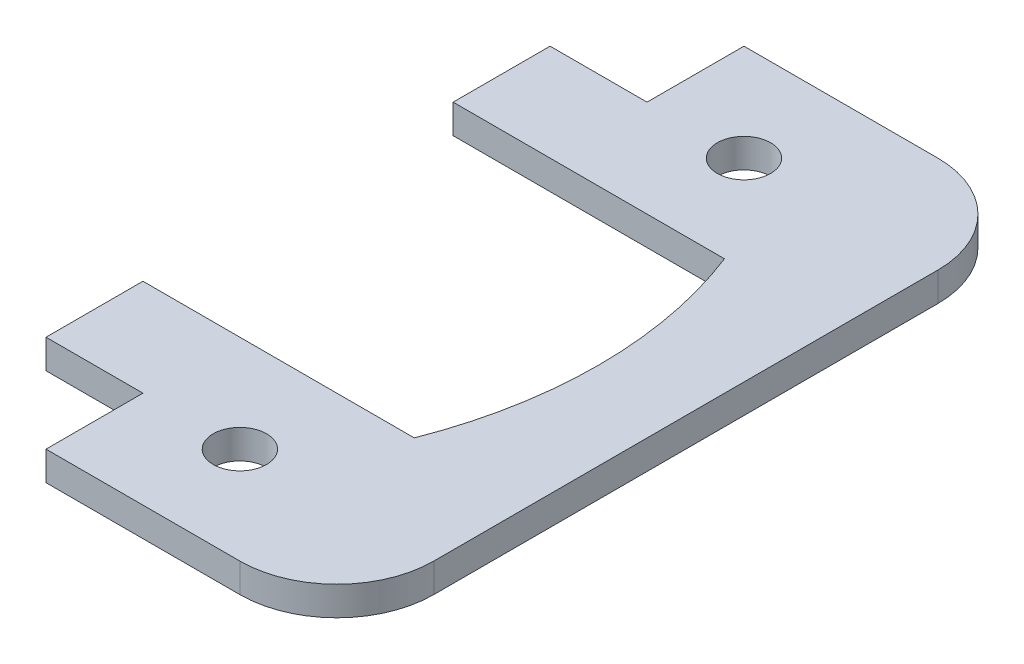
ISO-10303-21;
HEADER;
FILE_DESCRIPTION(('STEP AP214'),'2;1');
FILE_NAME('part.step','',(''),(''),'','','');
FILE_SCHEMA(('AUTOMOTIVE_DESIGN { 1 0 10303 214 1 1 1 1 }'));
ENDSEC;
DATA;
#1=APPLICATION_CONTEXT('core data for automotive mechanical design processes');
#2=APPLICATION_PROTOCOL_DEFINITION('international standard','automotive_design',2000,#1);
#3=PRODUCT_CONTEXT('',#1,'mechanical');
#4=PRODUCT('Part','Part','',(#3));
#5=PRODUCT_RELATED_PRODUCT_CATEGORY('part','',(#4));
#6=PRODUCT_DEFINITION_FORMATION('','',#4);
#7=PRODUCT_DEFINITION_CONTEXT('part definition',#1,'design');
#8=PRODUCT_DEFINITION('design','',#6,#7);
#9=PRODUCT_DEFINITION_SHAPE('','',#8);
#10=(LENGTH_UNIT() NAMED_UNIT(*) SI_UNIT(.MILLI.,.METRE.));
#11=(NAMED_UNIT(*) PLANE_ANGLE_UNIT() SI_UNIT($,.RADIAN.));
#12=(NAMED_UNIT(*) SI_UNIT($,.STERADIAN.) SOLID_ANGLE_UNIT());
#13=UNCERTAINTY_MEASURE_WITH_UNIT(LENGTH_MEASURE(1.E-05),#10,'distance_accuracy_value','');
#14=(GEOMETRIC_REPRESENTATION_CONTEXT(3) GLOBAL_UNCERTAINTY_ASSIGNED_CONTEXT((#13)) GLOBAL_UNIT_ASSIGNED_CONTEXT((#10,
#11,#12)) REPRESENTATION_CONTEXT('',''));
#15=CARTESIAN_POINT('',(0.,0.,0.));
#16=DIRECTION('',(0.,0.,1.));
#17=DIRECTION('',(1.,0.,0.));
#18=AXIS2_PLACEMENT_3D('',#15,#16,#17);
#19=CARTESIAN_POINT('',(0.,3.,0.));
#20=DIRECTION('',(0.,1.,0.));
#21=DIRECTION('',(0.,0.,1.));
#22=AXIS2_PLACEMENT_3D('',#19,#20,#21);
#23=PLANE('',#22);
#24=CARTESIAN_POINT('',(33.,3.,-26.));
#25=DIRECTION('',(0.,1.,0.));
#26=DIRECTION('',(0.,0.,1.));
#27=AXIS2_PLACEMENT_3D('',#24,#25,#26);
#28=CIRCLE('',#27,2.75);
#29=CARTESIAN_POINT('',(33.,3.,-23.25));
#30=VERTEX_POINT('',#29);
#31=EDGE_CURVE('E168',#30,#30,#28,.T.);
#32=ORIENTED_EDGE('',*,*,#31,.F.);
#33=EDGE_LOOP('',(#32));
#34=FACE_BOUND('',#33,.T.);
#35=CARTESIAN_POINT('',(0.,3.,0.));
#36=DIRECTION('',(0.,-1.,0.));
#37=DIRECTION('',(0.,0.,1.));
#38=AXIS2_PLACEMENT_3D('',#35,#36,#37);
#39=CIRCLE('',#38,44.);
#40=CARTESIAN_POINT('',(40.9878030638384,3.,-16.));
#41=VERTEX_POINT('',#40);
#42=CARTESIAN_POINT('',(40.9878030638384,3.,16.));
#43=VERTEX_POINT('',#42);
#44=EDGE_CURVE('E191',#41,#43,#39,.T.);
#45=ORIENTED_EDGE('',*,*,#44,.T.);
#46=DIRECTION('',(-1.,0.,0.));
#47=VECTOR('',#46,1.);
#48=CARTESIAN_POINT('',(13.,3.,16.));
#49=LINE('',#48,#47);
#50=CARTESIAN_POINT('',(13.,3.,16.));
#51=VERTEX_POINT('',#50);
#52=EDGE_CURVE('E109',#43,#51,#49,.T.);
#53=ORIENTED_EDGE('',*,*,#52,.T.);
#54=DIRECTION('',(0.,0.,1.));
#55=VECTOR('',#54,1.);
#56=CARTESIAN_POINT('',(13.,3.,26.));
#57=LINE('',#56,#55);
#58=CARTESIAN_POINT('',(13.,3.,26.));
#59=VERTEX_POINT('',#58);
#60=EDGE_CURVE('E224',#51,#59,#57,.T.);
#61=ORIENTED_EDGE('',*,*,#60,.T.);
#62=DIRECTION('',(1.,0.,0.));
#63=VECTOR('',#62,1.);
#64=CARTESIAN_POINT('',(23.,3.,26.));
#65=LINE('',#64,#63);
#66=CARTESIAN_POINT('',(23.,3.,26.));
#67=VERTEX_POINT('',#66);
#68=EDGE_CURVE('E243',#59,#67,#65,.T.);
#69=ORIENTED_EDGE('',*,*,#68,.T.);
#70=DIRECTION('',(0.,0.,1.));
#71=VECTOR('',#70,1.);
#72=CARTESIAN_POINT('',(23.,3.,36.));
#73=LINE('',#72,#71);
#74=CARTESIAN_POINT('',(23.,3.,36.));
#75=VERTEX_POINT('',#74);
#76=EDGE_CURVE('E240',#67,#75,#73,.T.);
#77=ORIENTED_EDGE('',*,*,#76,.T.);
#78=DIRECTION('',(1.,0.,0.));
#79=VECTOR('',#78,1.);
#80=CARTESIAN_POINT('',(42.9999999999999,3.,36.));
#81=LINE('',#80,#79);
#82=CARTESIAN_POINT('',(42.9999999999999,3.,36.));
#83=VERTEX_POINT('',#82);
#84=EDGE_CURVE('E242',#75,#83,#81,.T.);
#85=ORIENTED_EDGE('',*,*,#84,.T.);
#86=CARTESIAN_POINT('',(43.,3.,26.));
#87=DIRECTION('',(0.,1.,0.));
#88=DIRECTION('',(0.,0.,1.));
#89=AXIS2_PLACEMENT_3D('',#86,#87,#88);
#90=CIRCLE('',#89,10.);
#91=CARTESIAN_POINT('',(53.,3.,25.9999999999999));
#92=VERTEX_POINT('',#91);
#93=EDGE_CURVE('E245',#83,#92,#90,.T.);
#94=ORIENTED_EDGE('',*,*,#93,.T.);
#95=DIRECTION('',(0.,0.,-1.));
#96=VECTOR('',#95,1.);
#97=CARTESIAN_POINT('',(53.,3.,-25.9999999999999));
#98=LINE('',#97,#96);
#99=CARTESIAN_POINT('',(53.,3.,-25.9999999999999));
#100=VERTEX_POINT('',#99);
#101=EDGE_CURVE('E251',#92,#100,#98,.T.);
#102=ORIENTED_EDGE('',*,*,#101,.T.);
#103=CARTESIAN_POINT('',(43.,3.,-26.));
#104=DIRECTION('',(0.,1.,0.));
#105=DIRECTION('',(0.,0.,1.));
#106=AXIS2_PLACEMENT_3D('',#103,#104,#105);
#107=CIRCLE('',#106,10.);
#108=CARTESIAN_POINT('',(42.9999999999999,3.,-36.));
#109=VERTEX_POINT('',#108);
#110=EDGE_CURVE('E253',#100,#109,#107,.T.);
#111=ORIENTED_EDGE('',*,*,#110,.T.);
#112=DIRECTION('',(-1.,0.,0.));
#113=VECTOR('',#112,1.);
#114=CARTESIAN_POINT('',(23.,3.,-36.));
#115=LINE('',#114,#113);
#116=CARTESIAN_POINT('',(23.,3.,-36.));
#117=VERTEX_POINT('',#116);
#118=EDGE_CURVE('E255',#109,#117,#115,.T.);
#119=ORIENTED_EDGE('',*,*,#118,.T.);
#120=DIRECTION('',(0.,0.,1.));
#121=VECTOR('',#120,1.);
#122=CARTESIAN_POINT('',(23.,3.,-26.));
#123=LINE('',#122,#121);
#124=CARTESIAN_POINT('',(23.,3.,-26.));
#125=VERTEX_POINT('',#124);
#126=EDGE_CURVE('E146',#117,#125,#123,.T.);
#127=ORIENTED_EDGE('',*,*,#126,.T.);
#128=DIRECTION('',(-1.,0.,0.));
#129=VECTOR('',#128,1.);
#130=CARTESIAN_POINT('',(23.,3.,-26.));
#131=LINE('',#130,#129);
#132=CARTESIAN_POINT('',(13.,3.,-26.));
#133=VERTEX_POINT('',#132);
#134=EDGE_CURVE('E140',#125,#133,#131,.T.);
#135=ORIENTED_EDGE('',*,*,#134,.T.);
#136=DIRECTION('',(0.,0.,1.));
#137=VECTOR('',#136,1.);
#138=CARTESIAN_POINT('',(13.,3.,-26.));
#139=LINE('',#138,#137);
#140=CARTESIAN_POINT('',(13.,3.,-16.));
#141=VERTEX_POINT('',#140);
#142=EDGE_CURVE('E144',#133,#141,#139,.T.);
#143=ORIENTED_EDGE('',*,*,#142,.T.);
#144=DIRECTION('',(1.,0.,0.));
#145=VECTOR('',#144,1.);
#146=CARTESIAN_POINT('',(13.,3.,-16.));
#147=LINE('',#146,#145);
#148=EDGE_CURVE('E48',#141,#41,#147,.T.);
#149=ORIENTED_EDGE('',*,*,#148,.T.);
#150=EDGE_LOOP('',(#45,#53,#61,#69,#77,#85,#94,#102,#111,#119,#127,#135,#143,#149));
#151=FACE_BOUND('',#150,.T.);
#152=CARTESIAN_POINT('',(33.,3.,26.));
#153=DIRECTION('',(0.,1.,0.));
#154=DIRECTION('',(0.,0.,1.));
#155=AXIS2_PLACEMENT_3D('',#152,#153,#154);
#156=CIRCLE('',#155,2.75);
#157=CARTESIAN_POINT('',(33.,3.,28.75));
#158=VERTEX_POINT('',#157);
#159=EDGE_CURVE('E298',#158,#158,#156,.T.);
#160=ORIENTED_EDGE('',*,*,#159,.F.);
#161=EDGE_LOOP('',(#160));
#162=FACE_BOUND('',#161,.T.);
#163=ADVANCED_FACE('F31',(#34,#151,#162),#23,.T.);
#164=CARTESIAN_POINT('',(0.,0.,0.));
#165=DIRECTION('',(0.,1.,0.));
#166=DIRECTION('',(0.,0.,1.));
#167=AXIS2_PLACEMENT_3D('',#164,#165,#166);
#168=PLANE('',#167);
#169=CARTESIAN_POINT('',(33.,0.,-26.));
#170=DIRECTION('',(0.,1.,0.));
#171=DIRECTION('',(0.,0.,1.));
#172=AXIS2_PLACEMENT_3D('',#169,#170,#171);
#173=CIRCLE('',#172,2.75);
#174=CARTESIAN_POINT('',(33.,0.,-23.25));
#175=VERTEX_POINT('',#174);
#176=EDGE_CURVE('E303',#175,#175,#173,.T.);
#177=ORIENTED_EDGE('',*,*,#176,.T.);
#178=EDGE_LOOP('',(#177));
#179=FACE_BOUND('',#178,.T.);
#180=CARTESIAN_POINT('',(0.,0.,0.));
#181=DIRECTION('',(0.,-1.,0.));
#182=DIRECTION('',(0.,0.,1.));
#183=AXIS2_PLACEMENT_3D('',#180,#181,#182);
#184=CIRCLE('',#183,44.);
#185=CARTESIAN_POINT('',(40.9878030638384,0.,-16.));
#186=VERTEX_POINT('',#185);
#187=CARTESIAN_POINT('',(40.9878030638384,0.,16.));
#188=VERTEX_POINT('',#187);
#189=EDGE_CURVE('E164',#186,#188,#184,.T.);
#190=ORIENTED_EDGE('',*,*,#189,.F.);
#191=DIRECTION('',(1.,0.,0.));
#192=VECTOR('',#191,1.);
#193=CARTESIAN_POINT('',(13.,0.,-16.));
#194=LINE('',#193,#192);
#195=CARTESIAN_POINT('',(13.,0.,-16.));
#196=VERTEX_POINT('',#195);
#197=EDGE_CURVE('E101',#196,#186,#194,.T.);
#198=ORIENTED_EDGE('',*,*,#197,.F.);
#199=DIRECTION('',(0.,0.,1.));
#200=VECTOR('',#199,1.);
#201=CARTESIAN_POINT('',(13.,0.,-26.));
#202=LINE('',#201,#200);
#203=CARTESIAN_POINT('',(13.,0.,-26.));
#204=VERTEX_POINT('',#203);
#205=EDGE_CURVE('E95',#204,#196,#202,.T.);
#206=ORIENTED_EDGE('',*,*,#205,.F.);
#207=DIRECTION('',(-1.,0.,0.));
#208=VECTOR('',#207,1.);
#209=CARTESIAN_POINT('',(23.,0.,-26.));
#210=LINE('',#209,#208);
#211=CARTESIAN_POINT('',(23.,0.,-26.));
#212=VERTEX_POINT('',#211);
#213=EDGE_CURVE('E154',#212,#204,#210,.T.);
#214=ORIENTED_EDGE('',*,*,#213,.F.);
#215=DIRECTION('',(0.,0.,1.));
#216=VECTOR('',#215,1.);
#217=CARTESIAN_POINT('',(23.,0.,-26.));
#218=LINE('',#217,#216);
#219=CARTESIAN_POINT('',(23.,0.,-36.));
#220=VERTEX_POINT('',#219);
#221=EDGE_CURVE('E186',#220,#212,#218,.T.);
#222=ORIENTED_EDGE('',*,*,#221,.F.);
#223=DIRECTION('',(-1.,0.,0.));
#224=VECTOR('',#223,1.);
#225=CARTESIAN_POINT('',(23.,0.,-36.));
#226=LINE('',#225,#224);
#227=CARTESIAN_POINT('',(42.9999999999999,0.,-36.));
#228=VERTEX_POINT('',#227);
#229=EDGE_CURVE('E184',#228,#220,#226,.T.);
#230=ORIENTED_EDGE('',*,*,#229,.F.);
#231=CARTESIAN_POINT('',(43.,0.,-26.));
#232=DIRECTION('',(0.,1.,0.));
#233=DIRECTION('',(0.,0.,1.));
#234=AXIS2_PLACEMENT_3D('',#231,#232,#233);
#235=CIRCLE('',#234,10.);
#236=CARTESIAN_POINT('',(53.,0.,-25.9999999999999));
#237=VERTEX_POINT('',#236);
#238=EDGE_CURVE('E182',#237,#228,#235,.T.);
#239=ORIENTED_EDGE('',*,*,#238,.F.);
#240=DIRECTION('',(0.,0.,-1.));
#241=VECTOR('',#240,1.);
#242=CARTESIAN_POINT('',(53.,0.,-25.9999999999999));
#243=LINE('',#242,#241);
#244=CARTESIAN_POINT('',(53.,0.,25.9999999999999));
#245=VERTEX_POINT('',#244);
#246=EDGE_CURVE('E180',#245,#237,#243,.T.);
#247=ORIENTED_EDGE('',*,*,#246,.F.);
#248=CARTESIAN_POINT('',(43.,0.,26.));
#249=DIRECTION('',(0.,1.,0.));
#250=DIRECTION('',(0.,0.,1.));
#251=AXIS2_PLACEMENT_3D('',#248,#249,#250);
#252=CIRCLE('',#251,10.);
#253=CARTESIAN_POINT('',(42.9999999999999,0.,36.));
#254=VERTEX_POINT('',#253);
#255=EDGE_CURVE('E178',#254,#245,#252,.T.);
#256=ORIENTED_EDGE('',*,*,#255,.F.);
#257=DIRECTION('',(1.,0.,0.));
#258=VECTOR('',#257,1.);
#259=CARTESIAN_POINT('',(42.9999999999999,0.,36.));
#260=LINE('',#259,#258);
#261=CARTESIAN_POINT('',(23.,0.,36.));
#262=VERTEX_POINT('',#261);
#263=EDGE_CURVE('E176',#262,#254,#260,.T.);
#264=ORIENTED_EDGE('',*,*,#263,.F.);
#265=DIRECTION('',(0.,0.,1.));
#266=VECTOR('',#265,1.);
#267=CARTESIAN_POINT('',(23.,0.,36.));
#268=LINE('',#267,#266);
#269=CARTESIAN_POINT('',(23.,0.,26.));
#270=VERTEX_POINT('',#269);
#271=EDGE_CURVE('E174',#270,#262,#268,.T.);
#272=ORIENTED_EDGE('',*,*,#271,.F.);
#273=DIRECTION('',(1.,0.,0.));
#274=VECTOR('',#273,1.);
#275=CARTESIAN_POINT('',(23.,0.,26.));
#276=LINE('',#275,#274);
#277=CARTESIAN_POINT('',(13.,0.,26.));
#278=VERTEX_POINT('',#277);
#279=EDGE_CURVE('E172',#278,#270,#276,.T.);
#280=ORIENTED_EDGE('',*,*,#279,.F.);
#281=DIRECTION('',(0.,0.,1.));
#282=VECTOR('',#281,1.);
#283=CARTESIAN_POINT('',(13.,0.,26.));
#284=LINE('',#283,#282);
#285=CARTESIAN_POINT('',(13.,0.,16.));
#286=VERTEX_POINT('',#285);
#287=EDGE_CURVE('E170',#286,#278,#284,.T.);
#288=ORIENTED_EDGE('',*,*,#287,.F.);
#289=DIRECTION('',(-1.,0.,0.));
#290=VECTOR('',#289,1.);
#291=CARTESIAN_POINT('',(13.,0.,16.));
#292=LINE('',#291,#290);
#293=EDGE_CURVE('E167',#188,#286,#292,.T.);
#294=ORIENTED_EDGE('',*,*,#293,.F.);
#295=EDGE_LOOP('',(#190,#198,#206,#214,#222,#230,#239,#247,#256,#264,#272,#280,#288,#294));
#296=FACE_BOUND('',#295,.T.);
#297=CARTESIAN_POINT('',(33.,0.,26.));
#298=DIRECTION('',(0.,1.,0.));
#299=DIRECTION('',(0.,0.,1.));
#300=AXIS2_PLACEMENT_3D('',#297,#298,#299);
#301=CIRCLE('',#300,2.75);
#302=CARTESIAN_POINT('',(33.,0.,28.75));
#303=VERTEX_POINT('',#302);
#304=EDGE_CURVE('E301',#303,#303,#301,.T.);
#305=ORIENTED_EDGE('',*,*,#304,.T.);
#306=EDGE_LOOP('',(#305));
#307=FACE_BOUND('',#306,.T.);
#308=ADVANCED_FACE('F228',(#179,#296,#307),#168,.F.);
#309=CARTESIAN_POINT('',(0.,3.,0.));
#310=DIRECTION('',(0.,-1.,0.));
#311=DIRECTION('',(0.,0.,-1.));
#312=AXIS2_PLACEMENT_3D('',#309,#310,#311);
#313=CYLINDRICAL_SURFACE('',#312,44.);
#314=ORIENTED_EDGE('',*,*,#189,.T.);
#315=DIRECTION('',(0.,-1.,0.));
#316=VECTOR('',#315,1.);
#317=CARTESIAN_POINT('',(40.9878030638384,3.,16.));
#318=LINE('',#317,#316);
#319=EDGE_CURVE('E11',#43,#188,#318,.T.);
#320=ORIENTED_EDGE('',*,*,#319,.F.);
#321=ORIENTED_EDGE('',*,*,#44,.F.);
#322=DIRECTION('',(0.,-1.,0.));
#323=VECTOR('',#322,1.);
#324=CARTESIAN_POINT('',(40.9878030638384,3.,-16.));
#325=LINE('',#324,#323);
#326=EDGE_CURVE('E160',#41,#186,#325,.T.);
#327=ORIENTED_EDGE('',*,*,#326,.T.);
#328=EDGE_LOOP('',(#314,#320,#321,#327));
#329=FACE_BOUND('',#328,.T.);
#330=ADVANCED_FACE('F33',(#329),#313,.F.);
#331=CARTESIAN_POINT('',(13.,3.,16.));
#332=DIRECTION('',(0.,0.,1.));
#333=DIRECTION('',(1.,0.,0.));
#334=AXIS2_PLACEMENT_3D('',#331,#332,#333);
#335=PLANE('',#334);
#336=ORIENTED_EDGE('',*,*,#293,.T.);
#337=DIRECTION('',(0.,-1.,0.));
#338=VECTOR('',#337,1.);
#339=CARTESIAN_POINT('',(13.,3.,16.));
#340=LINE('',#339,#338);
#341=EDGE_CURVE('E40',#51,#286,#340,.T.);
#342=ORIENTED_EDGE('',*,*,#341,.F.);
#343=ORIENTED_EDGE('',*,*,#52,.F.);
#344=ORIENTED_EDGE('',*,*,#319,.T.);
#345=EDGE_LOOP('',(#336,#342,#343,#344));
#346=FACE_BOUND('',#345,.T.);
#347=ADVANCED_FACE('F416',(#346),#335,.F.);
#348=CARTESIAN_POINT('',(13.,3.,26.));
#349=DIRECTION('',(1.,0.,0.));
#350=DIRECTION('',(0.,0.,-1.));
#351=AXIS2_PLACEMENT_3D('',#348,#349,#350);
#352=PLANE('',#351);
#353=ORIENTED_EDGE('',*,*,#287,.T.);
#354=DIRECTION('',(0.,-1.,0.));
#355=VECTOR('',#354,1.);
#356=CARTESIAN_POINT('',(13.,3.,26.));
#357=LINE('',#356,#355);
#358=EDGE_CURVE('E216',#59,#278,#357,.T.);
#359=ORIENTED_EDGE('',*,*,#358,.F.);
#360=ORIENTED_EDGE('',*,*,#60,.F.);
#361=ORIENTED_EDGE('',*,*,#341,.T.);
#362=EDGE_LOOP('',(#353,#359,#360,#361));
#363=FACE_BOUND('',#362,.T.);
#364=ADVANCED_FACE('F222',(#363),#352,.F.);
#365=CARTESIAN_POINT('',(23.,3.,26.));
#366=DIRECTION('',(0.,0.,-1.));
#367=DIRECTION('',(-1.,0.,0.));
#368=AXIS2_PLACEMENT_3D('',#365,#366,#367);
#369=PLANE('',#368);
#370=ORIENTED_EDGE('',*,*,#279,.T.);
#371=DIRECTION('',(0.,-1.,0.));
#372=VECTOR('',#371,1.);
#373=CARTESIAN_POINT('',(23.,3.,26.));
#374=LINE('',#373,#372);
#375=EDGE_CURVE('E213',#67,#270,#374,.T.);
#376=ORIENTED_EDGE('',*,*,#375,.F.);
#377=ORIENTED_EDGE('',*,*,#68,.F.);
#378=ORIENTED_EDGE('',*,*,#358,.T.);
#379=EDGE_LOOP('',(#370,#376,#377,#378));
#380=FACE_BOUND('',#379,.T.);
#381=ADVANCED_FACE('F234',(#380),#369,.F.);
#382=CARTESIAN_POINT('',(23.,3.,36.));
#383=DIRECTION('',(1.,0.,0.));
#384=DIRECTION('',(0.,0.,-1.));
#385=AXIS2_PLACEMENT_3D('',#382,#383,#384);
#386=PLANE('',#385);
#387=ORIENTED_EDGE('',*,*,#271,.T.);
#388=DIRECTION('',(0.,-1.,0.));
#389=VECTOR('',#388,1.);
#390=CARTESIAN_POINT('',(23.,3.,36.));
#391=LINE('',#390,#389);
#392=EDGE_CURVE('E210',#75,#262,#391,.T.);
#393=ORIENTED_EDGE('',*,*,#392,.F.);
#394=ORIENTED_EDGE('',*,*,#76,.F.);
#395=ORIENTED_EDGE('',*,*,#375,.T.);
#396=EDGE_LOOP('',(#387,#393,#394,#395));
#397=FACE_BOUND('',#396,.T.);
#398=ADVANCED_FACE('F238',(#397),#386,.F.);
#399=CARTESIAN_POINT('',(42.9999999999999,3.,36.));
#400=DIRECTION('',(0.,0.,-1.));
#401=DIRECTION('',(-1.,0.,0.));
#402=AXIS2_PLACEMENT_3D('',#399,#400,#401);
#403=PLANE('',#402);
#404=ORIENTED_EDGE('',*,*,#263,.T.);
#405=DIRECTION('',(0.,-1.,0.));
#406=VECTOR('',#405,1.);
#407=CARTESIAN_POINT('',(42.9999999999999,3.,36.));
#408=LINE('',#407,#406);
#409=EDGE_CURVE('E207',#83,#254,#408,.T.);
#410=ORIENTED_EDGE('',*,*,#409,.F.);
#411=ORIENTED_EDGE('',*,*,#84,.F.);
#412=ORIENTED_EDGE('',*,*,#392,.T.);
#413=EDGE_LOOP('',(#404,#410,#411,#412));
#414=FACE_BOUND('',#413,.T.);
#415=ADVANCED_FACE('F381',(#414),#403,.F.);
#416=CARTESIAN_POINT('',(43.,3.,26.));
#417=DIRECTION('',(0.,-1.,0.));
#418=DIRECTION('',(0.,0.,-1.));
#419=AXIS2_PLACEMENT_3D('',#416,#417,#418);
#420=CYLINDRICAL_SURFACE('',#419,10.);
#421=ORIENTED_EDGE('',*,*,#255,.T.);
#422=DIRECTION('',(0.,-1.,0.));
#423=VECTOR('',#422,1.);
#424=CARTESIAN_POINT('',(53.,3.,25.9999999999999));
#425=LINE('',#424,#423);
#426=EDGE_CURVE('E204',#92,#245,#425,.T.);
#427=ORIENTED_EDGE('',*,*,#426,.F.);
#428=ORIENTED_EDGE('',*,*,#93,.F.);
#429=ORIENTED_EDGE('',*,*,#409,.T.);
#430=EDGE_LOOP('',(#421,#427,#428,#429));
#431=FACE_BOUND('',#430,.T.);
#432=ADVANCED_FACE('F371',(#431),#420,.T.);
#433=CARTESIAN_POINT('',(53.,3.,-25.9999999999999));
#434=DIRECTION('',(-1.,0.,0.));
#435=DIRECTION('',(0.,0.,1.));
#436=AXIS2_PLACEMENT_3D('',#433,#434,#435);
#437=PLANE('',#436);
#438=ORIENTED_EDGE('',*,*,#246,.T.);
#439=DIRECTION('',(0.,-1.,0.));
#440=VECTOR('',#439,1.);
#441=CARTESIAN_POINT('',(53.,3.,-25.9999999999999));
#442=LINE('',#441,#440);
#443=EDGE_CURVE('E201',#100,#237,#442,.T.);
#444=ORIENTED_EDGE('',*,*,#443,.F.);
#445=ORIENTED_EDGE('',*,*,#101,.F.);
#446=ORIENTED_EDGE('',*,*,#426,.T.);
#447=EDGE_LOOP('',(#438,#444,#445,#446));
#448=FACE_BOUND('',#447,.T.);
#449=ADVANCED_FACE('F361',(#448),#437,.F.);
#450=CARTESIAN_POINT('',(43.,3.,-26.));
#451=DIRECTION('',(0.,-1.,0.));
#452=DIRECTION('',(0.,0.,-1.));
#453=AXIS2_PLACEMENT_3D('',#450,#451,#452);
#454=CYLINDRICAL_SURFACE('',#453,10.);
#455=ORIENTED_EDGE('',*,*,#238,.T.);
#456=DIRECTION('',(0.,-1.,0.));
#457=VECTOR('',#456,1.);
#458=CARTESIAN_POINT('',(42.9999999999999,3.,-36.));
#459=LINE('',#458,#457);
#460=EDGE_CURVE('E198',#109,#228,#459,.T.);
#461=ORIENTED_EDGE('',*,*,#460,.F.);
#462=ORIENTED_EDGE('',*,*,#110,.F.);
#463=ORIENTED_EDGE('',*,*,#443,.T.);
#464=EDGE_LOOP('',(#455,#461,#462,#463));
#465=FACE_BOUND('',#464,.T.);
#466=ADVANCED_FACE('F352',(#465),#454,.T.);
#467=CARTESIAN_POINT('',(23.,3.,-36.));
#468=DIRECTION('',(0.,0.,1.));
#469=DIRECTION('',(1.,0.,0.));
#470=AXIS2_PLACEMENT_3D('',#467,#468,#469);
#471=PLANE('',#470);
#472=ORIENTED_EDGE('',*,*,#229,.T.);
#473=DIRECTION('',(0.,-1.,0.));
#474=VECTOR('',#473,1.);
#475=CARTESIAN_POINT('',(23.,3.,-36.));
#476=LINE('',#475,#474);
#477=EDGE_CURVE('E195',#117,#220,#476,.T.);
#478=ORIENTED_EDGE('',*,*,#477,.F.);
#479=ORIENTED_EDGE('',*,*,#118,.F.);
#480=ORIENTED_EDGE('',*,*,#460,.T.);
#481=EDGE_LOOP('',(#472,#478,#479,#480));
#482=FACE_BOUND('',#481,.T.);
#483=ADVANCED_FACE('F261',(#482),#471,.F.);
#484=CARTESIAN_POINT('',(23.,3.,-26.));
#485=DIRECTION('',(1.,0.,0.));
#486=DIRECTION('',(0.,0.,-1.));
#487=AXIS2_PLACEMENT_3D('',#484,#485,#486);
#488=PLANE('',#487);
#489=ORIENTED_EDGE('',*,*,#221,.T.);
#490=DIRECTION('',(0.,-1.,0.));
#491=VECTOR('',#490,1.);
#492=CARTESIAN_POINT('',(23.,3.,-26.));
#493=LINE('',#492,#491);
#494=EDGE_CURVE('E155',#125,#212,#493,.T.);
#495=ORIENTED_EDGE('',*,*,#494,.F.);
#496=ORIENTED_EDGE('',*,*,#126,.F.);
#497=ORIENTED_EDGE('',*,*,#477,.T.);
#498=EDGE_LOOP('',(#489,#495,#496,#497));
#499=FACE_BOUND('',#498,.T.);
#500=ADVANCED_FACE('F265',(#499),#488,.F.);
#501=CARTESIAN_POINT('',(23.,3.,-26.));
#502=DIRECTION('',(0.,0.,1.));
#503=DIRECTION('',(1.,0.,0.));
#504=AXIS2_PLACEMENT_3D('',#501,#502,#503);
#505=PLANE('',#504);
#506=ORIENTED_EDGE('',*,*,#213,.T.);
#507=DIRECTION('',(0.,-1.,0.));
#508=VECTOR('',#507,1.);
#509=CARTESIAN_POINT('',(13.,3.,-26.));
#510=LINE('',#509,#508);
#511=EDGE_CURVE('E151',#133,#204,#510,.T.);
#512=ORIENTED_EDGE('',*,*,#511,.F.);
#513=ORIENTED_EDGE('',*,*,#134,.F.);
#514=ORIENTED_EDGE('',*,*,#494,.T.);
#515=EDGE_LOOP('',(#506,#512,#513,#514));
#516=FACE_BOUND('',#515,.T.);
#517=ADVANCED_FACE('F152',(#516),#505,.F.);
#518=CARTESIAN_POINT('',(13.,3.,-26.));
#519=DIRECTION('',(1.,0.,0.));
#520=DIRECTION('',(0.,0.,-1.));
#521=AXIS2_PLACEMENT_3D('',#518,#519,#520);
#522=PLANE('',#521);
#523=ORIENTED_EDGE('',*,*,#205,.T.);
#524=DIRECTION('',(0.,-1.,0.));
#525=VECTOR('',#524,1.);
#526=CARTESIAN_POINT('',(13.,3.,-16.));
#527=LINE('',#526,#525);
#528=EDGE_CURVE('E156',#141,#196,#527,.T.);
#529=ORIENTED_EDGE('',*,*,#528,.F.);
#530=ORIENTED_EDGE('',*,*,#142,.F.);
#531=ORIENTED_EDGE('',*,*,#511,.T.);
#532=EDGE_LOOP('',(#523,#529,#530,#531));
#533=FACE_BOUND('',#532,.T.);
#534=ADVANCED_FACE('F158',(#533),#522,.F.);
#535=CARTESIAN_POINT('',(13.,3.,-16.));
#536=DIRECTION('',(0.,0.,-1.));
#537=DIRECTION('',(-1.,0.,0.));
#538=AXIS2_PLACEMENT_3D('',#535,#536,#537);
#539=PLANE('',#538);
#540=ORIENTED_EDGE('',*,*,#197,.T.);
#541=ORIENTED_EDGE('',*,*,#326,.F.);
#542=ORIENTED_EDGE('',*,*,#148,.F.);
#543=ORIENTED_EDGE('',*,*,#528,.T.);
#544=EDGE_LOOP('',(#540,#541,#542,#543));
#545=FACE_BOUND('',#544,.T.);
#546=ADVANCED_FACE('F269',(#545),#539,.F.);
#547=CARTESIAN_POINT('',(33.,3.,-26.));
#548=DIRECTION('',(0.,-1.,0.));
#549=DIRECTION('',(0.,0.,-1.));
#550=AXIS2_PLACEMENT_3D('',#547,#548,#549);
#551=CYLINDRICAL_SURFACE('',#550,2.75);
#552=ORIENTED_EDGE('',*,*,#31,.T.);
#553=EDGE_LOOP('',(#552));
#554=FACE_BOUND('',#553,.T.);
#555=ORIENTED_EDGE('',*,*,#176,.F.);
#556=EDGE_LOOP('',(#555));
#557=FACE_BOUND('',#556,.T.);
#558=ADVANCED_FACE('F271',(#554,#557),#551,.F.);
#559=CARTESIAN_POINT('',(33.,3.,26.));
#560=DIRECTION('',(0.,-1.,0.));
#561=DIRECTION('',(0.,0.,-1.));
#562=AXIS2_PLACEMENT_3D('',#559,#560,#561);
#563=CYLINDRICAL_SURFACE('',#562,2.75);
#564=ORIENTED_EDGE('',*,*,#159,.T.);
#565=EDGE_LOOP('',(#564));
#566=FACE_BOUND('',#565,.T.);
#567=ORIENTED_EDGE('',*,*,#304,.F.);
#568=EDGE_LOOP('',(#567));
#569=FACE_BOUND('',#568,.T.);
#570=ADVANCED_FACE('F277',(#566,#569),#563,.F.);
#571=CLOSED_SHELL('',(#163,#308,#330,#347,#364,#381,#398,#415,#432,#449,#466,#483,#500,#517,
#534,#546,#558,#570));
#572=MANIFOLD_SOLID_BREP('B2',#571);
#573=ADVANCED_BREP_SHAPE_REPRESENTATION('',(#18,#572),#14);
#574=SHAPE_DEFINITION_REPRESENTATION(#9,#573);
ENDSEC;
END-ISO-10303-21;
